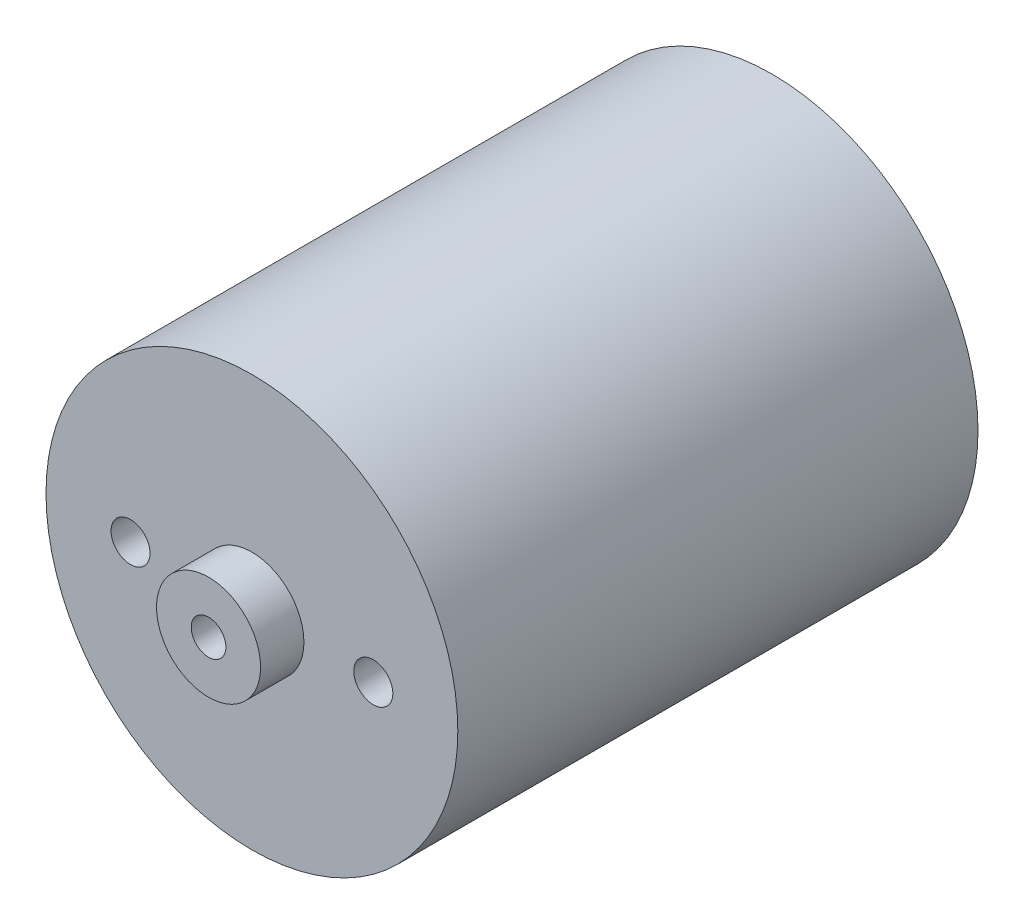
from build123d import *

# Parameters (mm, degrees)
SKETCH1_R           = 12.065
BOSS_EXTRUDE2_DEPTH = 30.48
SKETCH3_R           = 3.048
BOSS_EXTRUDE3_DEPTH = 2.54
SKETCH4_R           = 1.143
CUT_EXTRUDE1_DEPTH  = 2.54
SKETCH5_R           = 1.016
CUT_EXTRUDE2_DEPTH  = 38.167846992


with BuildPart() as part:
    # Sketch1 → Boss-Extrude2 (new body)
    with BuildSketch(Plane.XY):
        Circle(SKETCH1_R)
    extrude(amount=-BOSS_EXTRUDE2_DEPTH)

    # Sketch3 → Boss-Extrude3 (add)
    with BuildSketch(Plane.XY):
        Circle(SKETCH3_R)
    extrude(amount=BOSS_EXTRUDE3_DEPTH)

    # Sketch4 → Cut-Extrude1 (cut)
    with BuildSketch(Plane.XY):
        with Locations((-7.112, 0)):
            Circle(SKETCH4_R)
        with Locations(Location((7.112, 0, 0), (0, 0, 180))):
            Circle(SKETCH4_R)
    extrude(amount=-CUT_EXTRUDE1_DEPTH, mode=Mode.SUBTRACT)

    # Sketch5 → Cut-Extrude2 (cut, through all)
    with BuildSketch(Plane.XY.offset(2.54)):
        Circle(SKETCH5_R)
    extrude(amount=-CUT_EXTRUDE2_DEPTH, mode=Mode.SUBTRACT)


solid = part.part
